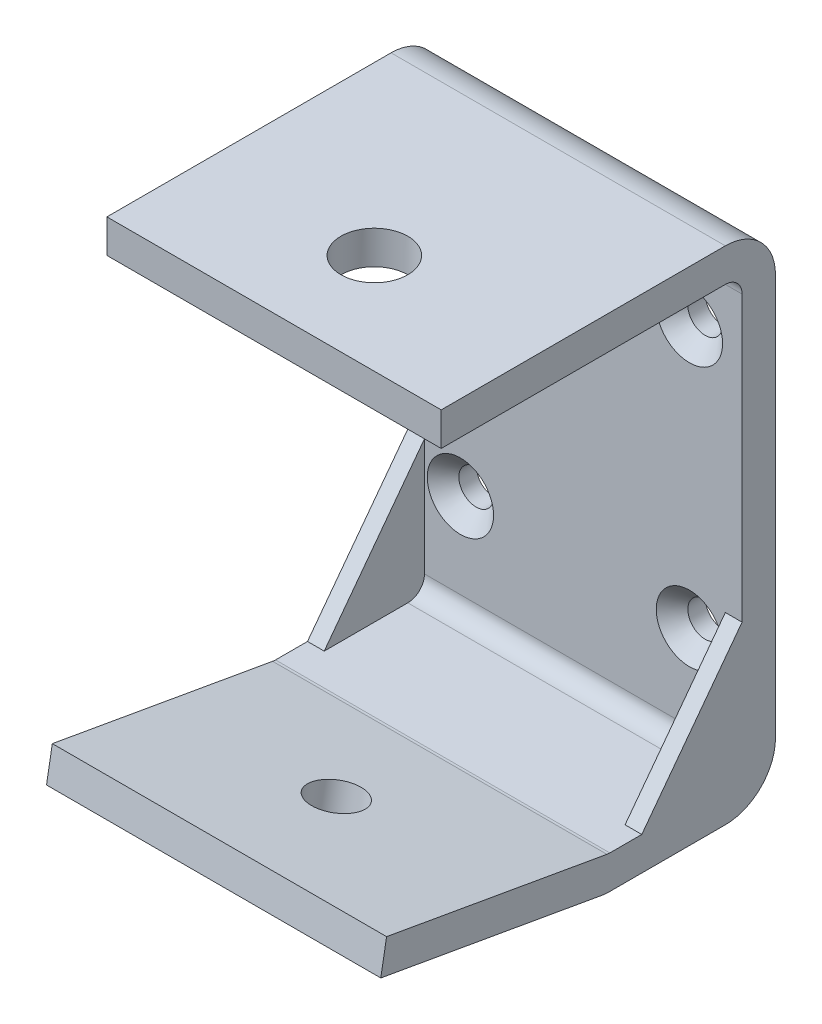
from build123d import *

# Parameters (mm, degrees)
BASE_EXTRUDE_THIN_DEPTH                         = 31.75
CUT_EXTRUDE1_REACH                              = 123.615
SKETCH2_R                                       = 6.35
BOSS_EXTRUDE1_DEPTH                             = 3.175
SKETCH5_R                                       = 4.7625
CUT_EXTRUDE2_DEPTH                              = 6.35
CSK_FOR_M6_OVAL_HEAD_MACHINE_SCREW1_D           = 6.6
CSK_FOR_M6_OVAL_HEAD_MACHINE_SCREW1_CSINK_D     = 12.6
CSK_FOR_M6_OVAL_HEAD_MACHINE_SCREW1_CSINK_ANGLE = 90


with BuildPart() as part:
    # Sketch1 → Base-Extrude-Thin (new, symmetric)
    with BuildSketch(Plane(origin=(0, 0, 0), x_dir=(0, 0, -1), z_dir=(1, 0, 0))):
        with BuildLine():
            Line((-67.523772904, 7.427557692), (-25.673556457, 0.048235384))
            ThreePointArc((-25.673556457, 0.048235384), (-25.398942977, 0.012081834), (-25.122223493, 0))
            Line((-25.122223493, 0), (-3.175, 0))
            ThreePointArc((-3.175, 0), (-0.92993597, 0.92993597), (0, 3.175))
            Line((0, 3.175), (0, 79.375))
            ThreePointArc((0, 79.375), (-0.92993597, 81.62006403), (-3.175, 82.55))
            Line((-3.175, 82.55), (-57.15, 82.55))
            Line((-57.15, 82.55), (-57.15, 88.9))
            Line((-57.15, 88.9), (-3.175, 88.9))
            ThreePointArc((-3.175, 88.9), (3.560192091, 86.110192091), (6.35, 79.375))
            Line((6.35, 79.375), (6.35, 3.175))
            ThreePointArc((6.35, 3.175), (3.560192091, -3.560192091), (-3.175, -6.35))
            Line((-3.175, -6.35), (-25.122223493, -6.35))
            ThreePointArc((-25.122223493, -6.35), (-25.952381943, -6.313754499), (-26.776222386, -6.205293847))
            Line((-26.776222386, -6.205293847), (-68.626438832, 1.174028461))
            Line((-68.626438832, 1.174028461), (-67.523772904, 7.427557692))
        make_face()
    extrude(amount=BASE_EXTRUDE_THIN_DEPTH, both=True)

    # Sketch2 → Cut-Extrude1 (cut, up to next)
    with BuildSketch(Plane(origin=(0, 88.9, 0), x_dir=(-1, 0, 0), z_dir=(0, 1, 0)), mode=Mode.PRIVATE) as cut_extrude1_sk1:
        with Locations(Location((0, 38.1, 0), (0, 0, 90))):
            Circle(SKETCH2_R)
    cut_extrude1_tool1 = extrude(cut_extrude1_sk1.sketch, amount=-CUT_EXTRUDE1_REACH, mode=Mode.PRIVATE) & part.part
    add(cut_extrude1_tool1.solids().sort_by_distance((0, 88.9, 38.1))[0], mode=Mode.SUBTRACT)

    # Sketch3 → Boss-Extrude1 (add)
    with BuildSketch(Plane(origin=(31.75, 0, 0), x_dir=(0, 0, -1), z_dir=(1, 0, 0))):
        with BuildLine():
            Line((-19.05, 0), (-3.175, 0))
            ThreePointArc((-3.175, 0), (-0.92993597, 0.92993597), (0, 3.175))
            Line((0, 3.175), (0, 25.4))
            Line((0, 25.4), (-19.05, 0))
        make_face()
    boss_extrude1 = extrude(amount=-BOSS_EXTRUDE1_DEPTH)

    # Mirror1: Boss-Extrude1 across plane
    add(boss_extrude1.mirror(Plane(origin=(0, 0, 0), x_dir=(0, 0, 1), z_dir=(1, 0, 0))))

    # Sketch5 → Cut-Extrude2 (cut)
    with BuildSketch(Plane(origin=(0, -10.597185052, 1.868569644), x_dir=(1, 0, 0), z_dir=(0, -0.984807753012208, 0.17364817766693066))):
        with Locations(Location((0, 45.239836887, 0), (0, 0, 270))):
            Circle(SKETCH5_R)
    extrude(amount=-CUT_EXTRUDE2_DEPTH, mode=Mode.SUBTRACT)

    # CSK for M6 Oval Head Machine Screw1 (through all)
    with Locations(Plane.XY):
        with Locations((-21.75, 69.375), (21.75, 69.375), (21.75, 19.375), (-21.75, 19.375)):
            CounterSinkHole(CSK_FOR_M6_OVAL_HEAD_MACHINE_SCREW1_D / 2, CSK_FOR_M6_OVAL_HEAD_MACHINE_SCREW1_CSINK_D / 2, counter_sink_angle=CSK_FOR_M6_OVAL_HEAD_MACHINE_SCREW1_CSINK_ANGLE)


solid = part.part
